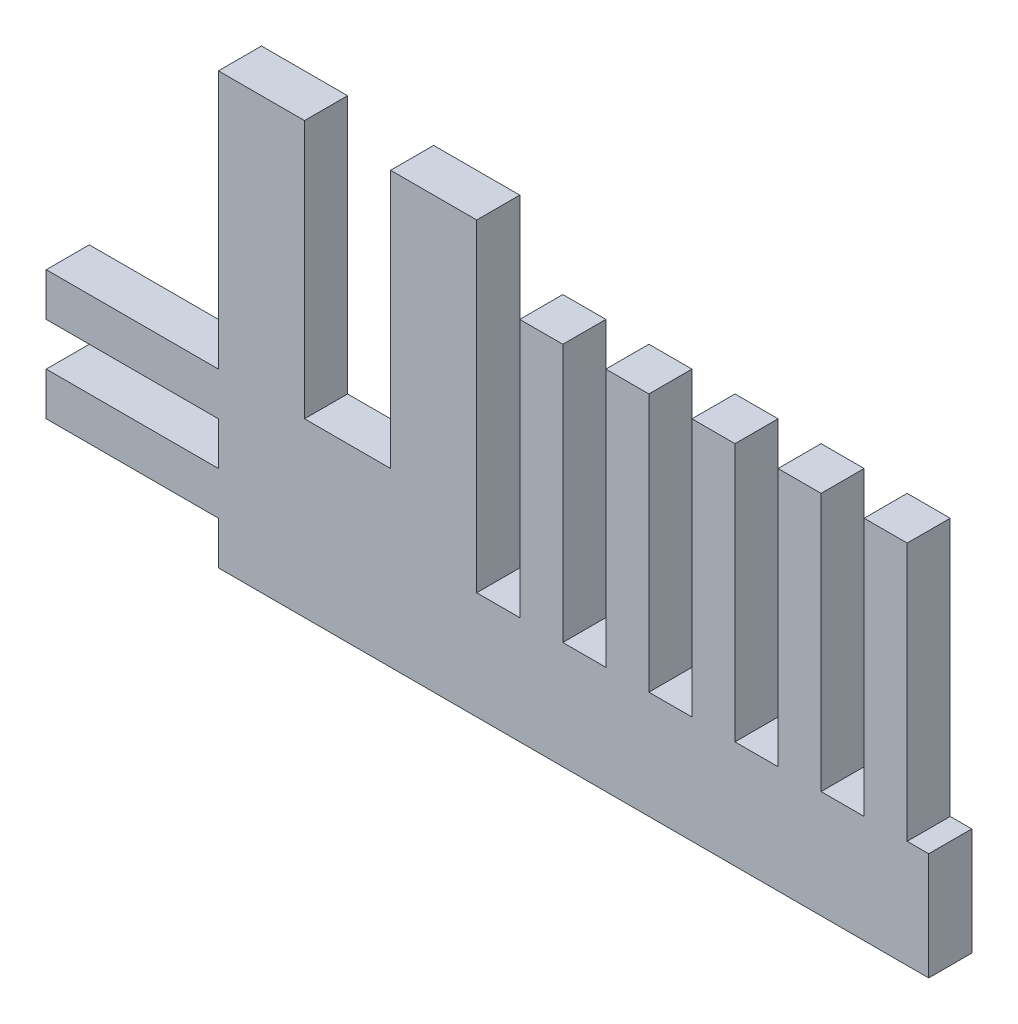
from build123d import *

# Parameters (mm, degrees)
EXTRUDE1_DEPTH = 1


with BuildPart() as part:
    # Sketch1 → Extrude1 (new body)
    with BuildSketch(Plane.XY):
        Polygon((0, 0), (0, 1), (-4, 1), (-4, 2), (0, 2), (0, 3), (-4, 3), (-4, 4), (0, 4), (0, 10), (2, 10), (2, 4), (4, 4), (4, 10), (6, 10), (6, 2.5), (6.5, 2.5), (7, 2.5), (7, 8.5), (8, 8.5), (8, 2.5), (8.5, 2.5), (9, 2.5), (9, 8.5), (10, 8.5), (10, 2.5), (10.5, 2.5), (11, 2.5), (11, 8.5), (12, 8.5), (12, 2.5), (12.5, 2.5), (13, 2.5), (13, 8.5), (14, 8.5), (14, 2.5), (14.5, 2.5), (15, 2.5), (15, 8.5), (16, 8.5), (16, 2.5), (16.5, 2.5), (16.5, 0), align=None)
    extrude(amount=EXTRUDE1_DEPTH)


solid = part.part
